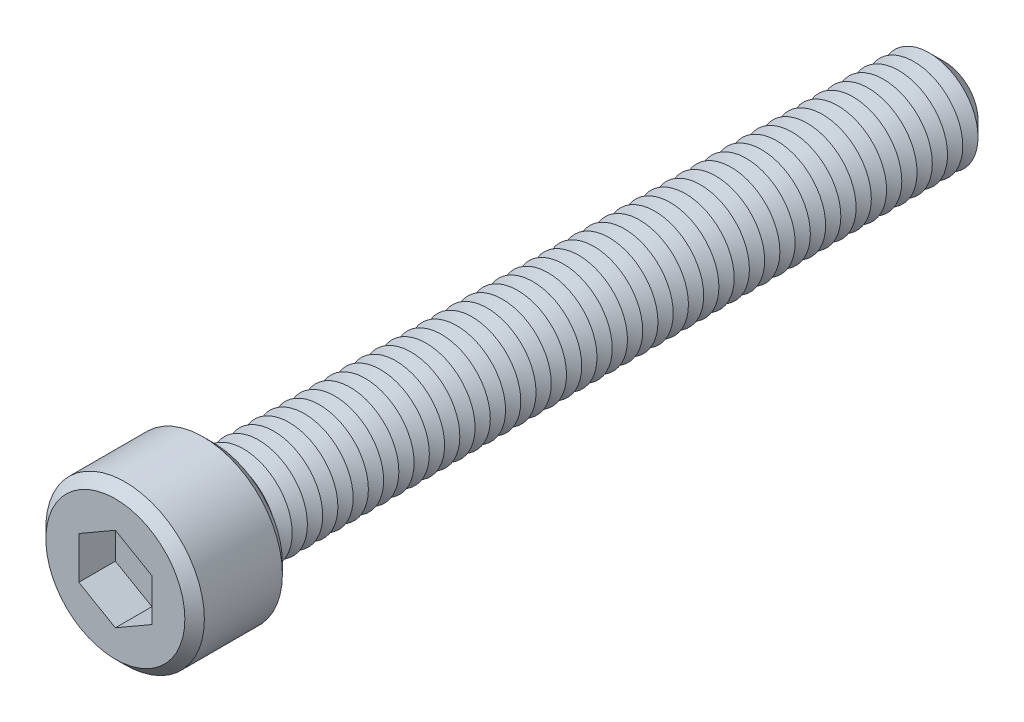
from build123d import *

# Parameters (mm, degrees)
SKETCH1_R           = 6.5
BOSS_EXTRUDE1_DEPTH = 8
SKETCH2_R           = 4
BOSS_EXTRUDE2_DEPTH = 60
CHAMFER1_SIZE       = 1.25
LPATTERN1_COUNT     = 47
LPATTERN1_PITCH     = 1.25
CUT_EXTRUDE1_DEPTH  = 3
SKETCH6_R           = 0.9
CUT_EXTRUDE2_DEPTH  = 65
CHAMFER2_SIZE       = 0.8


with BuildPart() as part:
    # Sketch1 → Boss-Extrude1 (new body)
    with BuildSketch(Plane.XY):
        Circle(SKETCH1_R)
    extrude(amount=BOSS_EXTRUDE1_DEPTH)

    # Sketch2 → Boss-Extrude2 (add)
    with BuildSketch(Plane(origin=(0, 0, 0), x_dir=(-1, 0, 0), z_dir=(0, 0, -1))):
        Circle(SKETCH2_R)
    extrude(amount=BOSS_EXTRUDE2_DEPTH)

    # Chamfer1
    chamfer1_edges = [part.edges().sort_by_distance(p)[0] for p in [
        (4, 0, -60),
    ]]
    chamfer(chamfer1_edges, length=CHAMFER1_SIZE)

    # Sketch4 → Cut-Revolve1 (revolve, cut)
    with BuildSketch(Plane(origin=(0, 0, 0), x_dir=(0, 0, -1), z_dir=(1, 0, 0)), mode=Mode.PRIVATE) as cut_revolve1_sk:
        Polygon((0, 4), (0.625, 2.917468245), (1.25, 4), align=None)
    cut_revolve1 = revolve(cut_revolve1_sk.sketch.rotate(Axis((0, 0, 2.512122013), (0, 0, -1)), 90), axis=Axis((0, 0, 2.512122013), (0, 0, -1)), mode=Mode.SUBTRACT)

    # LPattern1: Cut-Revolve1 ×47
    with Locations(*[(0, 0, -i * LPATTERN1_PITCH) for i in range(1, LPATTERN1_COUNT)]):
        add(cut_revolve1, mode=Mode.SUBTRACT)

    # Sketch5 → Cut-Extrude1 (cut)
    with BuildSketch(Plane.XY.offset(8)):
        Polygon((0, 3.464101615), (-3, 1.732050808), (-3, -1.732050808), (0, -3.464101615), (3, -1.732050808), (3, 1.732050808), align=None)
    extrude(amount=-CUT_EXTRUDE1_DEPTH, mode=Mode.SUBTRACT)

    # Sketch6 → Cut-Extrude2 (cut)
    with BuildSketch(Plane.XY.offset(5)):
        Circle(SKETCH6_R)
    extrude(amount=-CUT_EXTRUDE2_DEPTH, mode=Mode.SUBTRACT)

    # Chamfer2
    chamfer2_edges = [part.edges().sort_by_distance(p)[0] for p in [
        (-6.5, 0, 0),
        (-6.5, 0, 8),
    ]]
    chamfer(chamfer2_edges, length=CHAMFER2_SIZE)


solid = part.part
